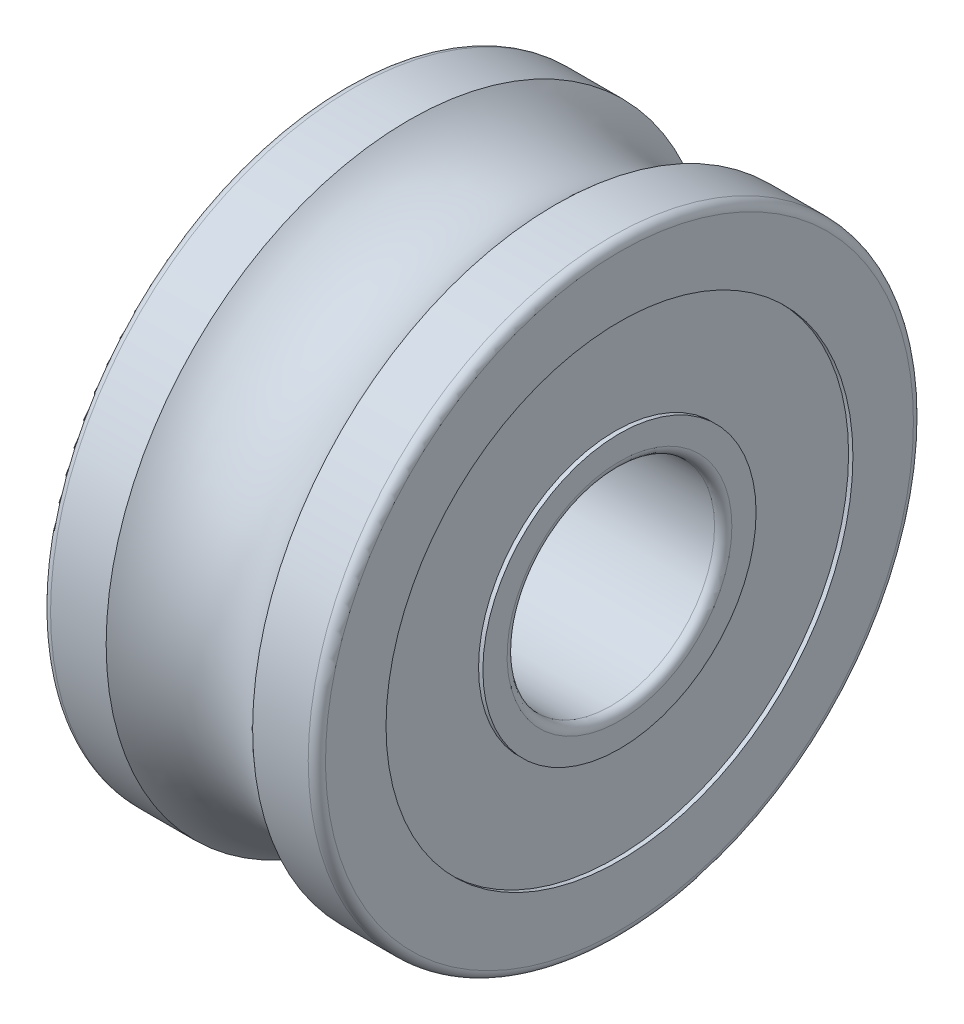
ISO-10303-21;
HEADER;
FILE_DESCRIPTION(('STEP AP214'),'2;1');
FILE_NAME('part.step','',(''),(''),'','','');
FILE_SCHEMA(('AUTOMOTIVE_DESIGN { 1 0 10303 214 1 1 1 1 }'));
ENDSEC;
DATA;
#1=APPLICATION_CONTEXT('core data for automotive mechanical design processes');
#2=APPLICATION_PROTOCOL_DEFINITION('international standard','automotive_design',2000,#1);
#3=PRODUCT_CONTEXT('',#1,'mechanical');
#4=PRODUCT('Part','Part','',(#3));
#5=PRODUCT_RELATED_PRODUCT_CATEGORY('part','',(#4));
#6=PRODUCT_DEFINITION_FORMATION('','',#4);
#7=PRODUCT_DEFINITION_CONTEXT('part definition',#1,'design');
#8=PRODUCT_DEFINITION('design','',#6,#7);
#9=PRODUCT_DEFINITION_SHAPE('','',#8);
#10=(LENGTH_UNIT() NAMED_UNIT(*) SI_UNIT(.MILLI.,.METRE.));
#11=(NAMED_UNIT(*) PLANE_ANGLE_UNIT() SI_UNIT($,.RADIAN.));
#12=(NAMED_UNIT(*) SI_UNIT($,.STERADIAN.) SOLID_ANGLE_UNIT());
#13=UNCERTAINTY_MEASURE_WITH_UNIT(LENGTH_MEASURE(1.E-05),#10,'distance_accuracy_value','');
#14=(GEOMETRIC_REPRESENTATION_CONTEXT(3) GLOBAL_UNCERTAINTY_ASSIGNED_CONTEXT((#13)) GLOBAL_UNIT_ASSIGNED_CONTEXT((#10,
#11,#12)) REPRESENTATION_CONTEXT('',''));
#15=CARTESIAN_POINT('',(0.,0.,0.));
#16=DIRECTION('',(0.,0.,1.));
#17=DIRECTION('',(1.,0.,0.));
#18=AXIS2_PLACEMENT_3D('',#15,#16,#17);
#19=CARTESIAN_POINT('',(0.,0.,0.));
#20=DIRECTION('',(1.,0.,0.));
#21=DIRECTION('',(0.,0.,-1.));
#22=AXIS2_PLACEMENT_3D('',#19,#20,#21);
#23=CYLINDRICAL_SURFACE('',#22,6.);
#24=CARTESIAN_POINT('',(-7.45,0.,0.));
#25=DIRECTION('',(1.,0.,0.));
#26=DIRECTION('',(0.,0.,-1.));
#27=AXIS2_PLACEMENT_3D('',#24,#25,#26);
#28=CIRCLE('',#27,6.);
#29=CARTESIAN_POINT('',(-7.45,0.,-6.));
#30=VERTEX_POINT('',#29);
#31=EDGE_CURVE('E152',#30,#30,#28,.T.);
#32=ORIENTED_EDGE('',*,*,#31,.F.);
#33=EDGE_LOOP('',(#32));
#34=FACE_BOUND('',#33,.T.);
#35=CARTESIAN_POINT('',(7.45,0.,0.));
#36=DIRECTION('',(1.,0.,0.));
#37=DIRECTION('',(0.,0.,-1.));
#38=AXIS2_PLACEMENT_3D('',#35,#36,#37);
#39=CIRCLE('',#38,6.);
#40=CARTESIAN_POINT('',(7.45,0.,-6.));
#41=VERTEX_POINT('',#40);
#42=EDGE_CURVE('E174',#41,#41,#39,.F.);
#43=ORIENTED_EDGE('',*,*,#42,.F.);
#44=EDGE_LOOP('',(#43));
#45=FACE_BOUND('',#44,.T.);
#46=ADVANCED_FACE('F14',(#34,#45),#23,.F.);
#47=CARTESIAN_POINT('',(7.45,0.,0.));
#48=DIRECTION('',(1.,0.,0.));
#49=DIRECTION('',(0.,0.,-1.));
#50=AXIS2_PLACEMENT_3D('',#47,#48,#49);
#51=TOROIDAL_SURFACE('',#50,6.5,0.5);
#52=ORIENTED_EDGE('',*,*,#42,.T.);
#53=EDGE_LOOP('',(#52));
#54=FACE_BOUND('',#53,.T.);
#55=CARTESIAN_POINT('',(7.95,0.,0.));
#56=DIRECTION('',(1.,0.,0.));
#57=DIRECTION('',(0.,1.,0.));
#58=AXIS2_PLACEMENT_3D('',#55,#56,#57);
#59=CIRCLE('',#58,6.5);
#60=CARTESIAN_POINT('',(7.95,6.5,0.));
#61=VERTEX_POINT('',#60);
#62=EDGE_CURVE('E141',#61,#61,#59,.F.);
#63=ORIENTED_EDGE('',*,*,#62,.F.);
#64=EDGE_LOOP('',(#63));
#65=FACE_BOUND('',#64,.T.);
#66=ADVANCED_FACE('F158',(#54,#65),#51,.T.);
#67=CARTESIAN_POINT('',(-7.45,0.,0.));
#68=DIRECTION('',(1.,0.,0.));
#69=DIRECTION('',(0.,0.,-1.));
#70=AXIS2_PLACEMENT_3D('',#67,#68,#69);
#71=TOROIDAL_SURFACE('',#70,6.5,0.5);
#72=CARTESIAN_POINT('',(-7.95,0.,0.));
#73=DIRECTION('',(-1.,0.,0.));
#74=DIRECTION('',(0.,1.,0.));
#75=AXIS2_PLACEMENT_3D('',#72,#73,#74);
#76=CIRCLE('',#75,6.5);
#77=CARTESIAN_POINT('',(-7.95,6.5,0.));
#78=VERTEX_POINT('',#77);
#79=EDGE_CURVE('E210',#78,#78,#76,.F.);
#80=ORIENTED_EDGE('',*,*,#79,.F.);
#81=EDGE_LOOP('',(#80));
#82=FACE_BOUND('',#81,.T.);
#83=ORIENTED_EDGE('',*,*,#31,.T.);
#84=EDGE_LOOP('',(#83));
#85=FACE_BOUND('',#84,.T.);
#86=ADVANCED_FACE('F154',(#82,#85),#71,.T.);
#87=CARTESIAN_POINT('',(7.95,6.95,0.));
#88=DIRECTION('',(1.,0.,0.));
#89=DIRECTION('',(0.,0.,-1.));
#90=AXIS2_PLACEMENT_3D('',#87,#88,#89);
#91=PLANE('',#90);
#92=ORIENTED_EDGE('',*,*,#62,.T.);
#93=EDGE_LOOP('',(#92));
#94=FACE_BOUND('',#93,.T.);
#95=CARTESIAN_POINT('',(7.95,0.,0.));
#96=DIRECTION('',(1.,0.,0.));
#97=DIRECTION('',(0.,0.,-1.));
#98=AXIS2_PLACEMENT_3D('',#95,#96,#97);
#99=CIRCLE('',#98,7.9);
#100=CARTESIAN_POINT('',(7.95,0.,-7.9));
#101=VERTEX_POINT('',#100);
#102=EDGE_CURVE('E18',#101,#101,#99,.F.);
#103=ORIENTED_EDGE('',*,*,#102,.F.);
#104=EDGE_LOOP('',(#103));
#105=FACE_BOUND('',#104,.T.);
#106=ADVANCED_FACE('F122',(#94,#105),#91,.T.);
#107=CARTESIAN_POINT('',(-7.95,6.95,0.));
#108=DIRECTION('',(-1.,0.,0.));
#109=DIRECTION('',(0.,0.,1.));
#110=AXIS2_PLACEMENT_3D('',#107,#108,#109);
#111=PLANE('',#110);
#112=ORIENTED_EDGE('',*,*,#79,.T.);
#113=EDGE_LOOP('',(#112));
#114=FACE_BOUND('',#113,.T.);
#115=CARTESIAN_POINT('',(-7.95,0.,0.));
#116=DIRECTION('',(1.,0.,0.));
#117=DIRECTION('',(0.,0.,-1.));
#118=AXIS2_PLACEMENT_3D('',#115,#116,#117);
#119=CIRCLE('',#118,7.9);
#120=CARTESIAN_POINT('',(-7.95,0.,-7.9));
#121=VERTEX_POINT('',#120);
#122=EDGE_CURVE('E206',#121,#121,#119,.T.);
#123=ORIENTED_EDGE('',*,*,#122,.F.);
#124=EDGE_LOOP('',(#123));
#125=FACE_BOUND('',#124,.T.);
#126=ADVANCED_FACE('F117',(#114,#125),#111,.T.);
#127=CARTESIAN_POINT('',(7.825,0.,0.));
#128=DIRECTION('',(1.,0.,0.));
#129=DIRECTION('',(0.,0.,-1.));
#130=AXIS2_PLACEMENT_3D('',#127,#128,#129);
#131=CYLINDRICAL_SURFACE('',#130,7.9);
#132=CARTESIAN_POINT('',(7.7,0.,0.));
#133=DIRECTION('',(1.,0.,0.));
#134=DIRECTION('',(0.,0.,-1.));
#135=AXIS2_PLACEMENT_3D('',#132,#133,#134);
#136=CIRCLE('',#135,7.9);
#137=CARTESIAN_POINT('',(7.7,0.,-7.9));
#138=VERTEX_POINT('',#137);
#139=EDGE_CURVE('E204',#138,#138,#136,.F.);
#140=ORIENTED_EDGE('',*,*,#139,.F.);
#141=EDGE_LOOP('',(#140));
#142=FACE_BOUND('',#141,.T.);
#143=ORIENTED_EDGE('',*,*,#102,.T.);
#144=EDGE_LOOP('',(#143));
#145=FACE_BOUND('',#144,.T.);
#146=ADVANCED_FACE('F113',(#142,#145),#131,.T.);
#147=CARTESIAN_POINT('',(-7.825,0.,0.));
#148=DIRECTION('',(1.,0.,0.));
#149=DIRECTION('',(0.,0.,-1.));
#150=AXIS2_PLACEMENT_3D('',#147,#148,#149);
#151=CYLINDRICAL_SURFACE('',#150,7.9);
#152=ORIENTED_EDGE('',*,*,#122,.T.);
#153=EDGE_LOOP('',(#152));
#154=FACE_BOUND('',#153,.T.);
#155=CARTESIAN_POINT('',(-7.7,0.,0.));
#156=DIRECTION('',(1.,0.,0.));
#157=DIRECTION('',(0.,0.,-1.));
#158=AXIS2_PLACEMENT_3D('',#155,#156,#157);
#159=CIRCLE('',#158,7.9);
#160=CARTESIAN_POINT('',(-7.7,0.,-7.9));
#161=VERTEX_POINT('',#160);
#162=EDGE_CURVE('E201',#161,#161,#159,.T.);
#163=ORIENTED_EDGE('',*,*,#162,.F.);
#164=EDGE_LOOP('',(#163));
#165=FACE_BOUND('',#164,.T.);
#166=ADVANCED_FACE('F109',(#154,#165),#151,.T.);
#167=CARTESIAN_POINT('',(7.7,10.7,0.));
#168=DIRECTION('',(1.,0.,0.));
#169=DIRECTION('',(0.,0.,-1.));
#170=AXIS2_PLACEMENT_3D('',#167,#168,#169);
#171=PLANE('',#170);
#172=ORIENTED_EDGE('',*,*,#139,.T.);
#173=EDGE_LOOP('',(#172));
#174=FACE_BOUND('',#173,.T.);
#175=CARTESIAN_POINT('',(7.7,0.,0.));
#176=DIRECTION('',(1.,0.,0.));
#177=DIRECTION('',(0.,0.,-1.));
#178=AXIS2_PLACEMENT_3D('',#175,#176,#177);
#179=CIRCLE('',#178,13.5);
#180=CARTESIAN_POINT('',(7.7,0.,-13.5));
#181=VERTEX_POINT('',#180);
#182=EDGE_CURVE('E198',#181,#181,#179,.T.);
#183=ORIENTED_EDGE('',*,*,#182,.T.);
#184=EDGE_LOOP('',(#183));
#185=FACE_BOUND('',#184,.T.);
#186=ADVANCED_FACE('F105',(#174,#185),#171,.T.);
#187=CARTESIAN_POINT('',(-7.7,10.7,0.));
#188=DIRECTION('',(-1.,0.,0.));
#189=DIRECTION('',(0.,0.,1.));
#190=AXIS2_PLACEMENT_3D('',#187,#188,#189);
#191=PLANE('',#190);
#192=ORIENTED_EDGE('',*,*,#162,.T.);
#193=EDGE_LOOP('',(#192));
#194=FACE_BOUND('',#193,.T.);
#195=CARTESIAN_POINT('',(-7.7,0.,0.));
#196=DIRECTION('',(1.,0.,0.));
#197=DIRECTION('',(0.,0.,-1.));
#198=AXIS2_PLACEMENT_3D('',#195,#196,#197);
#199=CIRCLE('',#198,13.5);
#200=CARTESIAN_POINT('',(-7.7,0.,-13.5));
#201=VERTEX_POINT('',#200);
#202=EDGE_CURVE('E195',#201,#201,#199,.F.);
#203=ORIENTED_EDGE('',*,*,#202,.T.);
#204=EDGE_LOOP('',(#203));
#205=FACE_BOUND('',#204,.T.);
#206=ADVANCED_FACE('F101',(#194,#205),#191,.T.);
#207=CARTESIAN_POINT('',(7.825,0.,0.));
#208=DIRECTION('',(1.,0.,0.));
#209=DIRECTION('',(0.,0.,-1.));
#210=AXIS2_PLACEMENT_3D('',#207,#208,#209);
#211=CYLINDRICAL_SURFACE('',#210,13.5);
#212=CARTESIAN_POINT('',(7.95,0.,0.));
#213=DIRECTION('',(1.,0.,0.));
#214=DIRECTION('',(0.,0.,-1.));
#215=AXIS2_PLACEMENT_3D('',#212,#213,#214);
#216=CIRCLE('',#215,13.5);
#217=CARTESIAN_POINT('',(7.95,0.,-13.5));
#218=VERTEX_POINT('',#217);
#219=EDGE_CURVE('E192',#218,#218,#216,.F.);
#220=ORIENTED_EDGE('',*,*,#219,.F.);
#221=EDGE_LOOP('',(#220));
#222=FACE_BOUND('',#221,.T.);
#223=ORIENTED_EDGE('',*,*,#182,.F.);
#224=EDGE_LOOP('',(#223));
#225=FACE_BOUND('',#224,.T.);
#226=ADVANCED_FACE('F97',(#222,#225),#211,.F.);
#227=CARTESIAN_POINT('',(-7.825,0.,0.));
#228=DIRECTION('',(1.,0.,0.));
#229=DIRECTION('',(0.,0.,-1.));
#230=AXIS2_PLACEMENT_3D('',#227,#228,#229);
#231=CYLINDRICAL_SURFACE('',#230,13.5);
#232=ORIENTED_EDGE('',*,*,#202,.F.);
#233=EDGE_LOOP('',(#232));
#234=FACE_BOUND('',#233,.T.);
#235=CARTESIAN_POINT('',(-7.95,0.,0.));
#236=DIRECTION('',(1.,0.,0.));
#237=DIRECTION('',(0.,0.,-1.));
#238=AXIS2_PLACEMENT_3D('',#235,#236,#237);
#239=CIRCLE('',#238,13.5);
#240=CARTESIAN_POINT('',(-7.95,0.,-13.5));
#241=VERTEX_POINT('',#240);
#242=EDGE_CURVE('E184',#241,#241,#239,.T.);
#243=ORIENTED_EDGE('',*,*,#242,.F.);
#244=EDGE_LOOP('',(#243));
#245=FACE_BOUND('',#244,.T.);
#246=ADVANCED_FACE('F92',(#234,#245),#231,.F.);
#247=CARTESIAN_POINT('',(7.95,15.5,0.));
#248=DIRECTION('',(1.,0.,0.));
#249=DIRECTION('',(0.,0.,-1.));
#250=AXIS2_PLACEMENT_3D('',#247,#248,#249);
#251=PLANE('',#250);
#252=ORIENTED_EDGE('',*,*,#219,.T.);
#253=EDGE_LOOP('',(#252));
#254=FACE_BOUND('',#253,.T.);
#255=CARTESIAN_POINT('',(7.95,0.,0.));
#256=DIRECTION('',(-1.,0.,0.));
#257=DIRECTION('',(0.,1.,0.));
#258=AXIS2_PLACEMENT_3D('',#255,#256,#257);
#259=CIRCLE('',#258,17.);
#260=CARTESIAN_POINT('',(7.95,17.,0.));
#261=VERTEX_POINT('',#260);
#262=EDGE_CURVE('E76',#261,#261,#259,.T.);
#263=ORIENTED_EDGE('',*,*,#262,.F.);
#264=EDGE_LOOP('',(#263));
#265=FACE_BOUND('',#264,.T.);
#266=ADVANCED_FACE('F82',(#254,#265),#251,.T.);
#267=CARTESIAN_POINT('',(-7.95,15.5,0.));
#268=DIRECTION('',(-1.,0.,0.));
#269=DIRECTION('',(0.,0.,1.));
#270=AXIS2_PLACEMENT_3D('',#267,#268,#269);
#271=PLANE('',#270);
#272=ORIENTED_EDGE('',*,*,#242,.T.);
#273=EDGE_LOOP('',(#272));
#274=FACE_BOUND('',#273,.T.);
#275=CARTESIAN_POINT('',(-7.95,0.,0.));
#276=DIRECTION('',(1.,0.,0.));
#277=DIRECTION('',(0.,1.,0.));
#278=AXIS2_PLACEMENT_3D('',#275,#276,#277);
#279=CIRCLE('',#278,17.);
#280=CARTESIAN_POINT('',(-7.95,17.,0.));
#281=VERTEX_POINT('',#280);
#282=EDGE_CURVE('E41',#281,#281,#279,.T.);
#283=ORIENTED_EDGE('',*,*,#282,.F.);
#284=EDGE_LOOP('',(#283));
#285=FACE_BOUND('',#284,.T.);
#286=ADVANCED_FACE('F91',(#274,#285),#271,.T.);
#287=CARTESIAN_POINT('',(7.45,0.,0.));
#288=DIRECTION('',(1.,0.,0.));
#289=DIRECTION('',(0.,0.,-1.));
#290=AXIS2_PLACEMENT_3D('',#287,#288,#289);
#291=TOROIDAL_SURFACE('',#290,17.,0.5);
#292=ORIENTED_EDGE('',*,*,#262,.T.);
#293=EDGE_LOOP('',(#292));
#294=FACE_BOUND('',#293,.T.);
#295=CARTESIAN_POINT('',(7.45,0.,0.));
#296=DIRECTION('',(1.,0.,0.));
#297=DIRECTION('',(0.,0.,-1.));
#298=AXIS2_PLACEMENT_3D('',#295,#296,#297);
#299=CIRCLE('',#298,17.5);
#300=CARTESIAN_POINT('',(7.45,0.,-17.5));
#301=VERTEX_POINT('',#300);
#302=EDGE_CURVE('E36',#301,#301,#299,.F.);
#303=ORIENTED_EDGE('',*,*,#302,.F.);
#304=EDGE_LOOP('',(#303));
#305=FACE_BOUND('',#304,.T.);
#306=ADVANCED_FACE('F55',(#294,#305),#291,.T.);
#307=CARTESIAN_POINT('',(-7.45,0.,0.));
#308=DIRECTION('',(1.,0.,0.));
#309=DIRECTION('',(0.,0.,-1.));
#310=AXIS2_PLACEMENT_3D('',#307,#308,#309);
#311=TOROIDAL_SURFACE('',#310,17.,0.5);
#312=CARTESIAN_POINT('',(-7.45,0.,0.));
#313=DIRECTION('',(1.,0.,0.));
#314=DIRECTION('',(0.,0.,-1.));
#315=AXIS2_PLACEMENT_3D('',#312,#313,#314);
#316=CIRCLE('',#315,17.5);
#317=CARTESIAN_POINT('',(-7.45,0.,-17.5));
#318=VERTEX_POINT('',#317);
#319=EDGE_CURVE('E27',#318,#318,#316,.T.);
#320=ORIENTED_EDGE('',*,*,#319,.F.);
#321=EDGE_LOOP('',(#320));
#322=FACE_BOUND('',#321,.T.);
#323=ORIENTED_EDGE('',*,*,#282,.T.);
#324=EDGE_LOOP('',(#323));
#325=FACE_BOUND('',#324,.T.);
#326=ADVANCED_FACE('F49',(#322,#325),#311,.T.);
#327=CARTESIAN_POINT('',(6.09263429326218,0.,0.));
#328=DIRECTION('',(1.,0.,0.));
#329=DIRECTION('',(0.,0.,-1.));
#330=AXIS2_PLACEMENT_3D('',#327,#328,#329);
#331=CYLINDRICAL_SURFACE('',#330,17.5);
#332=ORIENTED_EDGE('',*,*,#302,.T.);
#333=EDGE_LOOP('',(#332));
#334=FACE_BOUND('',#333,.T.);
#335=CARTESIAN_POINT('',(4.23526858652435,0.,0.));
#336=DIRECTION('',(-1.,0.,0.));
#337=DIRECTION('',(0.,0.,1.));
#338=AXIS2_PLACEMENT_3D('',#335,#336,#337);
#339=CIRCLE('',#338,17.5);
#340=CARTESIAN_POINT('',(4.23526858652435,0.,17.5));
#341=VERTEX_POINT('',#340);
#342=EDGE_CURVE('E22',#341,#341,#339,.T.);
#343=ORIENTED_EDGE('',*,*,#342,.F.);
#344=EDGE_LOOP('',(#343));
#345=FACE_BOUND('',#344,.T.);
#346=ADVANCED_FACE('F54',(#334,#345),#331,.T.);
#347=CARTESIAN_POINT('',(-6.09263429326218,0.,0.));
#348=DIRECTION('',(1.,0.,0.));
#349=DIRECTION('',(0.,0.,-1.));
#350=AXIS2_PLACEMENT_3D('',#347,#348,#349);
#351=CYLINDRICAL_SURFACE('',#350,17.5);
#352=ORIENTED_EDGE('',*,*,#319,.T.);
#353=EDGE_LOOP('',(#352));
#354=FACE_BOUND('',#353,.T.);
#355=CARTESIAN_POINT('',(-4.23526858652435,0.,0.));
#356=DIRECTION('',(1.,0.,0.));
#357=DIRECTION('',(0.,0.,-1.));
#358=AXIS2_PLACEMENT_3D('',#355,#356,#357);
#359=CIRCLE('',#358,17.5);
#360=CARTESIAN_POINT('',(-4.23526858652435,0.,-17.5));
#361=VERTEX_POINT('',#360);
#362=EDGE_CURVE('E10',#361,#361,#359,.T.);
#363=ORIENTED_EDGE('',*,*,#362,.F.);
#364=EDGE_LOOP('',(#363));
#365=FACE_BOUND('',#364,.T.);
#366=ADVANCED_FACE('F226',(#354,#365),#351,.T.);
#367=CARTESIAN_POINT('',(0.,0.,0.));
#368=DIRECTION('',(1.,0.,0.));
#369=DIRECTION('',(0.,0.,-1.));
#370=AXIS2_PLACEMENT_3D('',#367,#368,#369);
#371=TOROIDAL_SURFACE('',#370,21.75,6.);
#372=ORIENTED_EDGE('',*,*,#362,.T.);
#373=EDGE_LOOP('',(#372));
#374=FACE_BOUND('',#373,.T.);
#375=ORIENTED_EDGE('',*,*,#342,.T.);
#376=EDGE_LOOP('',(#375));
#377=FACE_BOUND('',#376,.T.);
#378=ADVANCED_FACE('F16',(#374,#377),#371,.F.);
#379=CLOSED_SHELL('',(#46,#66,#86,#106,#126,#146,#166,#186,#206,#226,#246,#266,#286,#306,#326,
#346,#366,#378));
#380=MANIFOLD_SOLID_BREP('B1',#379);
#381=ADVANCED_BREP_SHAPE_REPRESENTATION('',(#18,#380),#14);
#382=SHAPE_DEFINITION_REPRESENTATION(#9,#381);
ENDSEC;
END-ISO-10303-21;
